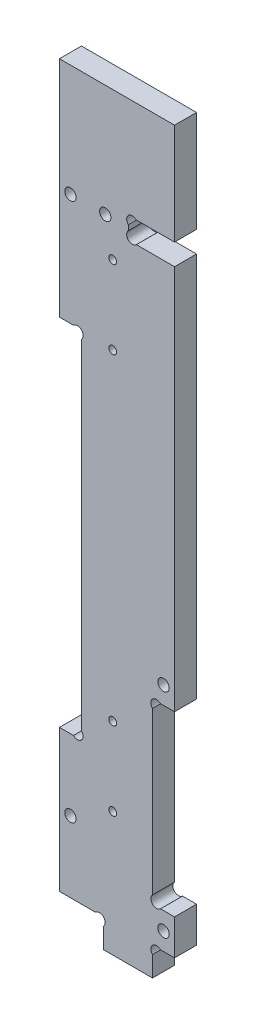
from build123d import *

# Parameters (mm, degrees)
ESQUISSE1_R      = 1.6
ESQUISSE1_R_2    = 1.1
EXTRUSION1_DEPTH = 6.2


with BuildPart() as part:
    # Esquisse1 → Extrusion1 (new body)
    with BuildSketch(Plane.XY):
        with BuildLine():
            Line((0, 150), (0, 213))
            Line((0, 213), (32.4, 213))
            Line((32.4, 213), (32.4, 184.5))
            Line((32.4, 184.5), (21.6627417, 184.5))
            ThreePointArc((21.6627417, 184.5), (19.4, 184.5), (19.4, 182.2372583))
            Line((19.4, 182.2372583), (19.4, 180.7627417))
            ThreePointArc((19.4, 180.7627417), (19.4, 178.5), (21.6627417, 178.5))
            Line((21.6627417, 178.5), (32.4, 178.5))
            Line((32.4, 178.5), (32.4, 70))
            Line((32.4, 70), (28.4627417, 70))
            ThreePointArc((28.4627417, 70), (26.2, 70), (26.2, 67.7372583))
            Line((26.2, 67.7372583), (26.2, 22.2627417))
            ThreePointArc((26.2, 22.2627417), (26.2, 20), (28.4627417, 20))
            Line((28.4627417, 20), (32.4, 20))
            Line((32.4, 20), (32.4, 10))
            Line((32.4, 10), (28.4627417, 10))
            ThreePointArc((28.4627417, 10), (26.2, 10), (26.2, 7.7372583))
            Line((26.2, 7.7372583), (26.2, 2))
            Line((26.2, 2), (12.4, 2))
            Line((12.4, 2), (12.4, 7.7372583))
            ThreePointArc((12.4, 7.7372583), (12.4, 10), (10.1372583, 10))
            Line((10.1372583, 10), (0, 10))
            Line((0, 10), (0, 50))
            Line((0, 50), (3.9372583, 50))
            ThreePointArc((3.9372583, 50), (6.2, 50), (6.2, 52.2627417))
            Line((6.2, 52.2627417), (6.2, 147.7372583))
            ThreePointArc((6.2, 147.7372583), (6.2, 150), (3.9372583, 150))
            Line((3.9372583, 150), (0, 150))
        make_face()
        with Locations(Location((3.1, 30, 0), (0, 0, 180))):
            Circle(ESQUISSE1_R, mode=Mode.SUBTRACT)
        with Locations(Location((3.1, 181.5, 0), (0, 0, 180))):
            Circle(ESQUISSE1_R, mode=Mode.SUBTRACT)
        with Locations(Location((29.3, 75, 0), (0, 0, 180))):
            Circle(ESQUISSE1_R, mode=Mode.SUBTRACT)
        with Locations(Location((29.3, 15, 0), (0, 0, 180))):
            Circle(ESQUISSE1_R, mode=Mode.SUBTRACT)
        with Locations(Location((15, 37, 0), (0, 0, 180))):
            Circle(ESQUISSE1_R_2, mode=Mode.SUBTRACT)
        with Locations(Location((15, 59, 0), (0, 0, 180))):
            Circle(ESQUISSE1_R_2, mode=Mode.SUBTRACT)
        with Locations(Location((15, 149.5, 0), (0, 0, 180))):
            Circle(ESQUISSE1_R_2, mode=Mode.SUBTRACT)
        with Locations(Location((15, 171.5, 0), (0, 0, 180))):
            Circle(ESQUISSE1_R_2, mode=Mode.SUBTRACT)
        with Locations(Location((12.9, 181.5, 0), (0, 0, 180))):
            Circle(ESQUISSE1_R, mode=Mode.SUBTRACT)
    extrude(amount=EXTRUSION1_DEPTH)


solid = part.part
